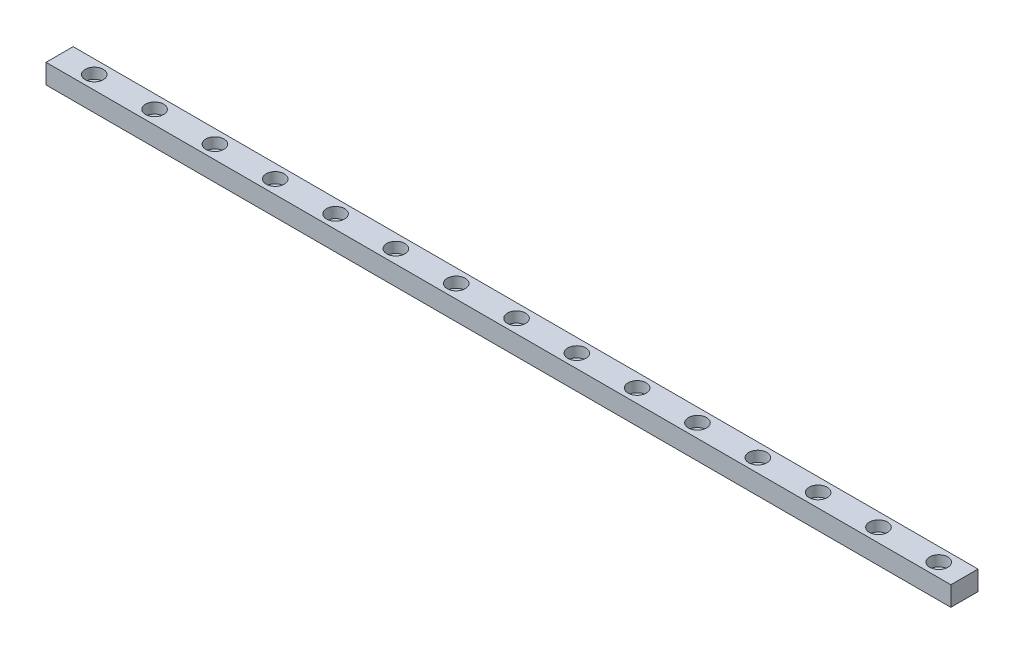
ISO-10303-21;
HEADER;
FILE_DESCRIPTION(('STEP AP214'),'2;1');
FILE_NAME('part.step','',(''),(''),'','','');
FILE_SCHEMA(('AUTOMOTIVE_DESIGN { 1 0 10303 214 1 1 1 1 }'));
ENDSEC;
DATA;
#1=APPLICATION_CONTEXT('core data for automotive mechanical design processes');
#2=APPLICATION_PROTOCOL_DEFINITION('international standard','automotive_design',2000,#1);
#3=PRODUCT_CONTEXT('',#1,'mechanical');
#4=PRODUCT('Part','Part','',(#3));
#5=PRODUCT_RELATED_PRODUCT_CATEGORY('part','',(#4));
#6=PRODUCT_DEFINITION_FORMATION('','',#4);
#7=PRODUCT_DEFINITION_CONTEXT('part definition',#1,'design');
#8=PRODUCT_DEFINITION('design','',#6,#7);
#9=PRODUCT_DEFINITION_SHAPE('','',#8);
#10=(LENGTH_UNIT() NAMED_UNIT(*) SI_UNIT(.MILLI.,.METRE.));
#11=(NAMED_UNIT(*) PLANE_ANGLE_UNIT() SI_UNIT($,.RADIAN.));
#12=(NAMED_UNIT(*) SI_UNIT($,.STERADIAN.) SOLID_ANGLE_UNIT());
#13=UNCERTAINTY_MEASURE_WITH_UNIT(LENGTH_MEASURE(1.E-05),#10,'distance_accuracy_value','');
#14=(GEOMETRIC_REPRESENTATION_CONTEXT(3) GLOBAL_UNCERTAINTY_ASSIGNED_CONTEXT((#13)) GLOBAL_UNIT_ASSIGNED_CONTEXT((#10,
#11,#12)) REPRESENTATION_CONTEXT('',''));
#15=CARTESIAN_POINT('',(0.,0.,0.));
#16=DIRECTION('',(0.,0.,1.));
#17=DIRECTION('',(1.,0.,0.));
#18=AXIS2_PLACEMENT_3D('',#15,#16,#17);
#19=CARTESIAN_POINT('',(141.5,-6.5,0.));
#20=DIRECTION('',(0.,1.,0.));
#21=DIRECTION('',(0.,0.,1.));
#22=AXIS2_PLACEMENT_3D('',#19,#20,#21);
#23=CYLINDRICAL_SURFACE('',#22,1.5);
#24=CARTESIAN_POINT('',(141.5,-6.5,0.));
#25=DIRECTION('',(0.,1.,0.));
#26=DIRECTION('',(0.,0.,1.));
#27=AXIS2_PLACEMENT_3D('',#24,#25,#26);
#28=CIRCLE('',#27,1.5);
#29=CARTESIAN_POINT('',(141.5,-6.5,1.5));
#30=VERTEX_POINT('',#29);
#31=EDGE_CURVE('E189',#30,#30,#28,.T.);
#32=ORIENTED_EDGE('',*,*,#31,.F.);
#33=EDGE_LOOP('',(#32));
#34=FACE_BOUND('',#33,.T.);
#35=CARTESIAN_POINT('',(141.5,-3.5,0.));
#36=DIRECTION('',(0.,1.,0.));
#37=DIRECTION('',(0.,0.,1.));
#38=AXIS2_PLACEMENT_3D('',#35,#36,#37);
#39=CIRCLE('',#38,1.5);
#40=CARTESIAN_POINT('',(141.5,-3.5,1.5));
#41=VERTEX_POINT('',#40);
#42=EDGE_CURVE('E47',#41,#41,#39,.F.);
#43=ORIENTED_EDGE('',*,*,#42,.F.);
#44=EDGE_LOOP('',(#43));
#45=FACE_BOUND('',#44,.T.);
#46=ADVANCED_FACE('F43',(#34,#45),#23,.F.);
#47=CARTESIAN_POINT('',(121.5,-6.5,0.));
#48=DIRECTION('',(0.,1.,0.));
#49=DIRECTION('',(0.,0.,1.));
#50=AXIS2_PLACEMENT_3D('',#47,#48,#49);
#51=CYLINDRICAL_SURFACE('',#50,1.5);
#52=CARTESIAN_POINT('',(121.5,-6.5,0.));
#53=DIRECTION('',(0.,1.,0.));
#54=DIRECTION('',(0.,0.,1.));
#55=AXIS2_PLACEMENT_3D('',#52,#53,#54);
#56=CIRCLE('',#55,1.5);
#57=CARTESIAN_POINT('',(121.5,-6.5,1.5));
#58=VERTEX_POINT('',#57);
#59=EDGE_CURVE('E194',#58,#58,#56,.T.);
#60=ORIENTED_EDGE('',*,*,#59,.F.);
#61=EDGE_LOOP('',(#60));
#62=FACE_BOUND('',#61,.T.);
#63=CARTESIAN_POINT('',(121.5,-3.5,0.));
#64=DIRECTION('',(0.,1.,0.));
#65=DIRECTION('',(0.,0.,1.));
#66=AXIS2_PLACEMENT_3D('',#63,#64,#65);
#67=CIRCLE('',#66,1.5);
#68=CARTESIAN_POINT('',(121.5,-3.5,1.5));
#69=VERTEX_POINT('',#68);
#70=EDGE_CURVE('E182',#69,#69,#67,.F.);
#71=ORIENTED_EDGE('',*,*,#70,.F.);
#72=EDGE_LOOP('',(#71));
#73=FACE_BOUND('',#72,.T.);
#74=ADVANCED_FACE('F431',(#62,#73),#51,.F.);
#75=CARTESIAN_POINT('',(101.5,-6.5,0.));
#76=DIRECTION('',(0.,1.,0.));
#77=DIRECTION('',(0.,0.,1.));
#78=AXIS2_PLACEMENT_3D('',#75,#76,#77);
#79=CYLINDRICAL_SURFACE('',#78,1.5);
#80=CARTESIAN_POINT('',(101.5,-6.5,0.));
#81=DIRECTION('',(0.,1.,0.));
#82=DIRECTION('',(0.,0.,1.));
#83=AXIS2_PLACEMENT_3D('',#80,#81,#82);
#84=CIRCLE('',#83,1.5);
#85=CARTESIAN_POINT('',(101.5,-6.5,1.5));
#86=VERTEX_POINT('',#85);
#87=EDGE_CURVE('E200',#86,#86,#84,.T.);
#88=ORIENTED_EDGE('',*,*,#87,.F.);
#89=EDGE_LOOP('',(#88));
#90=FACE_BOUND('',#89,.T.);
#91=CARTESIAN_POINT('',(101.5,-3.5,0.));
#92=DIRECTION('',(0.,1.,0.));
#93=DIRECTION('',(0.,0.,1.));
#94=AXIS2_PLACEMENT_3D('',#91,#92,#93);
#95=CIRCLE('',#94,1.5);
#96=CARTESIAN_POINT('',(101.5,-3.5,1.5));
#97=VERTEX_POINT('',#96);
#98=EDGE_CURVE('E179',#97,#97,#95,.F.);
#99=ORIENTED_EDGE('',*,*,#98,.F.);
#100=EDGE_LOOP('',(#99));
#101=FACE_BOUND('',#100,.T.);
#102=ADVANCED_FACE('F437',(#90,#101),#79,.F.);
#103=CARTESIAN_POINT('',(81.5,-6.5,0.));
#104=DIRECTION('',(0.,1.,0.));
#105=DIRECTION('',(0.,0.,1.));
#106=AXIS2_PLACEMENT_3D('',#103,#104,#105);
#107=CYLINDRICAL_SURFACE('',#106,1.5);
#108=CARTESIAN_POINT('',(81.5,-6.5,0.));
#109=DIRECTION('',(0.,1.,0.));
#110=DIRECTION('',(0.,0.,1.));
#111=AXIS2_PLACEMENT_3D('',#108,#109,#110);
#112=CIRCLE('',#111,1.5);
#113=CARTESIAN_POINT('',(81.5,-6.5,1.5));
#114=VERTEX_POINT('',#113);
#115=EDGE_CURVE('E247',#114,#114,#112,.T.);
#116=ORIENTED_EDGE('',*,*,#115,.F.);
#117=EDGE_LOOP('',(#116));
#118=FACE_BOUND('',#117,.T.);
#119=CARTESIAN_POINT('',(81.5,-3.5,0.));
#120=DIRECTION('',(0.,1.,0.));
#121=DIRECTION('',(0.,0.,1.));
#122=AXIS2_PLACEMENT_3D('',#119,#120,#121);
#123=CIRCLE('',#122,1.5);
#124=CARTESIAN_POINT('',(81.5,-3.5,1.5));
#125=VERTEX_POINT('',#124);
#126=EDGE_CURVE('E175',#125,#125,#123,.F.);
#127=ORIENTED_EDGE('',*,*,#126,.F.);
#128=EDGE_LOOP('',(#127));
#129=FACE_BOUND('',#128,.T.);
#130=ADVANCED_FACE('F444',(#118,#129),#107,.F.);
#131=CARTESIAN_POINT('',(61.5,-6.5,0.));
#132=DIRECTION('',(0.,1.,0.));
#133=DIRECTION('',(0.,0.,1.));
#134=AXIS2_PLACEMENT_3D('',#131,#132,#133);
#135=CYLINDRICAL_SURFACE('',#134,1.5);
#136=CARTESIAN_POINT('',(61.5,-6.5,0.));
#137=DIRECTION('',(0.,1.,0.));
#138=DIRECTION('',(0.,0.,1.));
#139=AXIS2_PLACEMENT_3D('',#136,#137,#138);
#140=CIRCLE('',#139,1.5);
#141=CARTESIAN_POINT('',(61.5,-6.5,1.5));
#142=VERTEX_POINT('',#141);
#143=EDGE_CURVE('E243',#142,#142,#140,.T.);
#144=ORIENTED_EDGE('',*,*,#143,.F.);
#145=EDGE_LOOP('',(#144));
#146=FACE_BOUND('',#145,.T.);
#147=CARTESIAN_POINT('',(61.5,-3.5,0.));
#148=DIRECTION('',(0.,1.,0.));
#149=DIRECTION('',(0.,0.,1.));
#150=AXIS2_PLACEMENT_3D('',#147,#148,#149);
#151=CIRCLE('',#150,1.5);
#152=CARTESIAN_POINT('',(61.5,-3.5,1.5));
#153=VERTEX_POINT('',#152);
#154=EDGE_CURVE('E171',#153,#153,#151,.F.);
#155=ORIENTED_EDGE('',*,*,#154,.F.);
#156=EDGE_LOOP('',(#155));
#157=FACE_BOUND('',#156,.T.);
#158=ADVANCED_FACE('F448',(#146,#157),#135,.F.);
#159=CARTESIAN_POINT('',(41.5,-6.5,0.));
#160=DIRECTION('',(0.,1.,0.));
#161=DIRECTION('',(0.,0.,1.));
#162=AXIS2_PLACEMENT_3D('',#159,#160,#161);
#163=CYLINDRICAL_SURFACE('',#162,1.5);
#164=CARTESIAN_POINT('',(41.5,-6.5,0.));
#165=DIRECTION('',(0.,1.,0.));
#166=DIRECTION('',(0.,0.,1.));
#167=AXIS2_PLACEMENT_3D('',#164,#165,#166);
#168=CIRCLE('',#167,1.5);
#169=CARTESIAN_POINT('',(41.5,-6.5,1.5));
#170=VERTEX_POINT('',#169);
#171=EDGE_CURVE('E239',#170,#170,#168,.T.);
#172=ORIENTED_EDGE('',*,*,#171,.F.);
#173=EDGE_LOOP('',(#172));
#174=FACE_BOUND('',#173,.T.);
#175=CARTESIAN_POINT('',(41.5,-3.5,0.));
#176=DIRECTION('',(0.,1.,0.));
#177=DIRECTION('',(0.,0.,1.));
#178=AXIS2_PLACEMENT_3D('',#175,#176,#177);
#179=CIRCLE('',#178,1.5);
#180=CARTESIAN_POINT('',(41.5,-3.5,1.5));
#181=VERTEX_POINT('',#180);
#182=EDGE_CURVE('E167',#181,#181,#179,.F.);
#183=ORIENTED_EDGE('',*,*,#182,.F.);
#184=EDGE_LOOP('',(#183));
#185=FACE_BOUND('',#184,.T.);
#186=ADVANCED_FACE('F452',(#174,#185),#163,.F.);
#187=CARTESIAN_POINT('',(21.5,-6.5,0.));
#188=DIRECTION('',(0.,1.,0.));
#189=DIRECTION('',(0.,0.,1.));
#190=AXIS2_PLACEMENT_3D('',#187,#188,#189);
#191=CYLINDRICAL_SURFACE('',#190,1.5);
#192=CARTESIAN_POINT('',(21.5,-6.5,0.));
#193=DIRECTION('',(0.,1.,0.));
#194=DIRECTION('',(0.,0.,1.));
#195=AXIS2_PLACEMENT_3D('',#192,#193,#194);
#196=CIRCLE('',#195,1.5);
#197=CARTESIAN_POINT('',(21.5,-6.5,1.5));
#198=VERTEX_POINT('',#197);
#199=EDGE_CURVE('E235',#198,#198,#196,.T.);
#200=ORIENTED_EDGE('',*,*,#199,.F.);
#201=EDGE_LOOP('',(#200));
#202=FACE_BOUND('',#201,.T.);
#203=CARTESIAN_POINT('',(21.5,-3.5,0.));
#204=DIRECTION('',(0.,1.,0.));
#205=DIRECTION('',(0.,0.,1.));
#206=AXIS2_PLACEMENT_3D('',#203,#204,#205);
#207=CIRCLE('',#206,1.5);
#208=CARTESIAN_POINT('',(21.5,-3.5,1.5));
#209=VERTEX_POINT('',#208);
#210=EDGE_CURVE('E163',#209,#209,#207,.F.);
#211=ORIENTED_EDGE('',*,*,#210,.F.);
#212=EDGE_LOOP('',(#211));
#213=FACE_BOUND('',#212,.T.);
#214=ADVANCED_FACE('F456',(#202,#213),#191,.F.);
#215=CARTESIAN_POINT('',(1.50000000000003,-6.5,0.));
#216=DIRECTION('',(0.,1.,0.));
#217=DIRECTION('',(0.,0.,1.));
#218=AXIS2_PLACEMENT_3D('',#215,#216,#217);
#219=CYLINDRICAL_SURFACE('',#218,1.5);
#220=CARTESIAN_POINT('',(1.50000000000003,-6.5,0.));
#221=DIRECTION('',(0.,1.,0.));
#222=DIRECTION('',(0.,0.,1.));
#223=AXIS2_PLACEMENT_3D('',#220,#221,#222);
#224=CIRCLE('',#223,1.5);
#225=CARTESIAN_POINT('',(1.50000000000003,-6.5,1.5));
#226=VERTEX_POINT('',#225);
#227=EDGE_CURVE('E231',#226,#226,#224,.T.);
#228=ORIENTED_EDGE('',*,*,#227,.F.);
#229=EDGE_LOOP('',(#228));
#230=FACE_BOUND('',#229,.T.);
#231=CARTESIAN_POINT('',(1.50000000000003,-3.5,0.));
#232=DIRECTION('',(0.,1.,0.));
#233=DIRECTION('',(0.,0.,1.));
#234=AXIS2_PLACEMENT_3D('',#231,#232,#233);
#235=CIRCLE('',#234,1.5);
#236=CARTESIAN_POINT('',(1.50000000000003,-3.5,1.5));
#237=VERTEX_POINT('',#236);
#238=EDGE_CURVE('E159',#237,#237,#235,.F.);
#239=ORIENTED_EDGE('',*,*,#238,.F.);
#240=EDGE_LOOP('',(#239));
#241=FACE_BOUND('',#240,.T.);
#242=ADVANCED_FACE('F460',(#230,#241),#219,.F.);
#243=CARTESIAN_POINT('',(-18.5,-6.5,0.));
#244=DIRECTION('',(0.,1.,0.));
#245=DIRECTION('',(0.,0.,1.));
#246=AXIS2_PLACEMENT_3D('',#243,#244,#245);
#247=CYLINDRICAL_SURFACE('',#246,1.5);
#248=CARTESIAN_POINT('',(-18.5,-6.5,0.));
#249=DIRECTION('',(0.,1.,0.));
#250=DIRECTION('',(0.,0.,1.));
#251=AXIS2_PLACEMENT_3D('',#248,#249,#250);
#252=CIRCLE('',#251,1.5);
#253=CARTESIAN_POINT('',(-18.5,-6.5,1.5));
#254=VERTEX_POINT('',#253);
#255=EDGE_CURVE('E227',#254,#254,#252,.T.);
#256=ORIENTED_EDGE('',*,*,#255,.F.);
#257=EDGE_LOOP('',(#256));
#258=FACE_BOUND('',#257,.T.);
#259=CARTESIAN_POINT('',(-18.5,-3.5,0.));
#260=DIRECTION('',(0.,1.,0.));
#261=DIRECTION('',(0.,0.,1.));
#262=AXIS2_PLACEMENT_3D('',#259,#260,#261);
#263=CIRCLE('',#262,1.5);
#264=CARTESIAN_POINT('',(-18.5,-3.5,1.5));
#265=VERTEX_POINT('',#264);
#266=EDGE_CURVE('E155',#265,#265,#263,.F.);
#267=ORIENTED_EDGE('',*,*,#266,.F.);
#268=EDGE_LOOP('',(#267));
#269=FACE_BOUND('',#268,.T.);
#270=ADVANCED_FACE('F464',(#258,#269),#247,.F.);
#271=CARTESIAN_POINT('',(-38.5,-6.5,0.));
#272=DIRECTION('',(0.,1.,0.));
#273=DIRECTION('',(0.,0.,1.));
#274=AXIS2_PLACEMENT_3D('',#271,#272,#273);
#275=CYLINDRICAL_SURFACE('',#274,1.5);
#276=CARTESIAN_POINT('',(-38.5,-6.5,0.));
#277=DIRECTION('',(0.,1.,0.));
#278=DIRECTION('',(0.,0.,1.));
#279=AXIS2_PLACEMENT_3D('',#276,#277,#278);
#280=CIRCLE('',#279,1.5);
#281=CARTESIAN_POINT('',(-38.5,-6.5,1.5));
#282=VERTEX_POINT('',#281);
#283=EDGE_CURVE('E223',#282,#282,#280,.T.);
#284=ORIENTED_EDGE('',*,*,#283,.F.);
#285=EDGE_LOOP('',(#284));
#286=FACE_BOUND('',#285,.T.);
#287=CARTESIAN_POINT('',(-38.5,-3.5,0.));
#288=DIRECTION('',(0.,1.,0.));
#289=DIRECTION('',(0.,0.,1.));
#290=AXIS2_PLACEMENT_3D('',#287,#288,#289);
#291=CIRCLE('',#290,1.5);
#292=CARTESIAN_POINT('',(-38.5,-3.5,1.5));
#293=VERTEX_POINT('',#292);
#294=EDGE_CURVE('E151',#293,#293,#291,.F.);
#295=ORIENTED_EDGE('',*,*,#294,.F.);
#296=EDGE_LOOP('',(#295));
#297=FACE_BOUND('',#296,.T.);
#298=ADVANCED_FACE('F468',(#286,#297),#275,.F.);
#299=CARTESIAN_POINT('',(-58.5,-6.5,0.));
#300=DIRECTION('',(0.,1.,0.));
#301=DIRECTION('',(0.,0.,1.));
#302=AXIS2_PLACEMENT_3D('',#299,#300,#301);
#303=CYLINDRICAL_SURFACE('',#302,1.5);
#304=CARTESIAN_POINT('',(-58.5,-6.5,0.));
#305=DIRECTION('',(0.,1.,0.));
#306=DIRECTION('',(0.,0.,1.));
#307=AXIS2_PLACEMENT_3D('',#304,#305,#306);
#308=CIRCLE('',#307,1.5);
#309=CARTESIAN_POINT('',(-58.5,-6.5,1.5));
#310=VERTEX_POINT('',#309);
#311=EDGE_CURVE('E219',#310,#310,#308,.T.);
#312=ORIENTED_EDGE('',*,*,#311,.F.);
#313=EDGE_LOOP('',(#312));
#314=FACE_BOUND('',#313,.T.);
#315=CARTESIAN_POINT('',(-58.5,-3.5,0.));
#316=DIRECTION('',(0.,1.,0.));
#317=DIRECTION('',(0.,0.,1.));
#318=AXIS2_PLACEMENT_3D('',#315,#316,#317);
#319=CIRCLE('',#318,1.5);
#320=CARTESIAN_POINT('',(-58.5,-3.5,1.5));
#321=VERTEX_POINT('',#320);
#322=EDGE_CURVE('E147',#321,#321,#319,.F.);
#323=ORIENTED_EDGE('',*,*,#322,.F.);
#324=EDGE_LOOP('',(#323));
#325=FACE_BOUND('',#324,.T.);
#326=ADVANCED_FACE('F472',(#314,#325),#303,.F.);
#327=CARTESIAN_POINT('',(-78.5,-6.5,0.));
#328=DIRECTION('',(0.,1.,0.));
#329=DIRECTION('',(0.,0.,1.));
#330=AXIS2_PLACEMENT_3D('',#327,#328,#329);
#331=CYLINDRICAL_SURFACE('',#330,1.5);
#332=CARTESIAN_POINT('',(-78.5,-6.5,0.));
#333=DIRECTION('',(0.,1.,0.));
#334=DIRECTION('',(0.,0.,1.));
#335=AXIS2_PLACEMENT_3D('',#332,#333,#334);
#336=CIRCLE('',#335,1.5);
#337=CARTESIAN_POINT('',(-78.5,-6.5,1.5));
#338=VERTEX_POINT('',#337);
#339=EDGE_CURVE('E215',#338,#338,#336,.T.);
#340=ORIENTED_EDGE('',*,*,#339,.F.);
#341=EDGE_LOOP('',(#340));
#342=FACE_BOUND('',#341,.T.);
#343=CARTESIAN_POINT('',(-78.5,-3.5,0.));
#344=DIRECTION('',(0.,1.,0.));
#345=DIRECTION('',(0.,0.,1.));
#346=AXIS2_PLACEMENT_3D('',#343,#344,#345);
#347=CIRCLE('',#346,1.5);
#348=CARTESIAN_POINT('',(-78.5,-3.5,1.5));
#349=VERTEX_POINT('',#348);
#350=EDGE_CURVE('E143',#349,#349,#347,.F.);
#351=ORIENTED_EDGE('',*,*,#350,.F.);
#352=EDGE_LOOP('',(#351));
#353=FACE_BOUND('',#352,.T.);
#354=ADVANCED_FACE('F476',(#342,#353),#331,.F.);
#355=CARTESIAN_POINT('',(-98.5,-6.5,0.));
#356=DIRECTION('',(0.,1.,0.));
#357=DIRECTION('',(0.,0.,1.));
#358=AXIS2_PLACEMENT_3D('',#355,#356,#357);
#359=CYLINDRICAL_SURFACE('',#358,1.5);
#360=CARTESIAN_POINT('',(-98.5,-6.5,0.));
#361=DIRECTION('',(0.,1.,0.));
#362=DIRECTION('',(0.,0.,1.));
#363=AXIS2_PLACEMENT_3D('',#360,#361,#362);
#364=CIRCLE('',#363,1.5);
#365=CARTESIAN_POINT('',(-98.5,-6.5,1.5));
#366=VERTEX_POINT('',#365);
#367=EDGE_CURVE('E211',#366,#366,#364,.T.);
#368=ORIENTED_EDGE('',*,*,#367,.F.);
#369=EDGE_LOOP('',(#368));
#370=FACE_BOUND('',#369,.T.);
#371=CARTESIAN_POINT('',(-98.5,-3.5,0.));
#372=DIRECTION('',(0.,1.,0.));
#373=DIRECTION('',(0.,0.,1.));
#374=AXIS2_PLACEMENT_3D('',#371,#372,#373);
#375=CIRCLE('',#374,1.5);
#376=CARTESIAN_POINT('',(-98.5,-3.5,1.5));
#377=VERTEX_POINT('',#376);
#378=EDGE_CURVE('E139',#377,#377,#375,.F.);
#379=ORIENTED_EDGE('',*,*,#378,.F.);
#380=EDGE_LOOP('',(#379));
#381=FACE_BOUND('',#380,.T.);
#382=ADVANCED_FACE('F480',(#370,#381),#359,.F.);
#383=CARTESIAN_POINT('',(-118.5,-6.5,0.));
#384=DIRECTION('',(0.,1.,0.));
#385=DIRECTION('',(0.,0.,1.));
#386=AXIS2_PLACEMENT_3D('',#383,#384,#385);
#387=CYLINDRICAL_SURFACE('',#386,1.5);
#388=CARTESIAN_POINT('',(-118.5,-6.5,0.));
#389=DIRECTION('',(0.,1.,0.));
#390=DIRECTION('',(0.,0.,1.));
#391=AXIS2_PLACEMENT_3D('',#388,#389,#390);
#392=CIRCLE('',#391,1.5);
#393=CARTESIAN_POINT('',(-118.5,-6.5,1.5));
#394=VERTEX_POINT('',#393);
#395=EDGE_CURVE('E207',#394,#394,#392,.T.);
#396=ORIENTED_EDGE('',*,*,#395,.F.);
#397=EDGE_LOOP('',(#396));
#398=FACE_BOUND('',#397,.T.);
#399=CARTESIAN_POINT('',(-118.5,-3.5,0.));
#400=DIRECTION('',(0.,1.,0.));
#401=DIRECTION('',(0.,0.,1.));
#402=AXIS2_PLACEMENT_3D('',#399,#400,#401);
#403=CIRCLE('',#402,1.5);
#404=CARTESIAN_POINT('',(-118.5,-3.5,1.5));
#405=VERTEX_POINT('',#404);
#406=EDGE_CURVE('E134',#405,#405,#403,.F.);
#407=ORIENTED_EDGE('',*,*,#406,.F.);
#408=EDGE_LOOP('',(#407));
#409=FACE_BOUND('',#408,.T.);
#410=ADVANCED_FACE('F484',(#398,#409),#387,.F.);
#411=CARTESIAN_POINT('',(-138.5,-6.5,0.));
#412=DIRECTION('',(0.,1.,0.));
#413=DIRECTION('',(0.,0.,1.));
#414=AXIS2_PLACEMENT_3D('',#411,#412,#413);
#415=CYLINDRICAL_SURFACE('',#414,1.5);
#416=CARTESIAN_POINT('',(-138.5,-6.5,0.));
#417=DIRECTION('',(0.,1.,0.));
#418=DIRECTION('',(0.,0.,1.));
#419=AXIS2_PLACEMENT_3D('',#416,#417,#418);
#420=CIRCLE('',#419,1.5);
#421=CARTESIAN_POINT('',(-138.5,-6.5,1.5));
#422=VERTEX_POINT('',#421);
#423=EDGE_CURVE('E119',#422,#422,#420,.T.);
#424=ORIENTED_EDGE('',*,*,#423,.F.);
#425=EDGE_LOOP('',(#424));
#426=FACE_BOUND('',#425,.T.);
#427=CARTESIAN_POINT('',(-138.5,-3.5,0.));
#428=DIRECTION('',(0.,1.,0.));
#429=DIRECTION('',(0.,0.,1.));
#430=AXIS2_PLACEMENT_3D('',#427,#428,#429);
#431=CIRCLE('',#430,1.5);
#432=CARTESIAN_POINT('',(-138.5,-3.5,1.5));
#433=VERTEX_POINT('',#432);
#434=EDGE_CURVE('E130',#433,#433,#431,.F.);
#435=ORIENTED_EDGE('',*,*,#434,.F.);
#436=EDGE_LOOP('',(#435));
#437=FACE_BOUND('',#436,.T.);
#438=ADVANCED_FACE('F388',(#426,#437),#415,.F.);
#439=CARTESIAN_POINT('',(150.,0.,-4.5));
#440=DIRECTION('',(0.,-1.,0.));
#441=DIRECTION('',(0.,0.,-1.));
#442=AXIS2_PLACEMENT_3D('',#439,#440,#441);
#443=PLANE('',#442);
#444=CARTESIAN_POINT('',(-138.5,0.,0.));
#445=DIRECTION('',(0.,1.,0.));
#446=DIRECTION('',(0.,0.,1.));
#447=AXIS2_PLACEMENT_3D('',#444,#445,#446);
#448=CIRCLE('',#447,2.99999999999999);
#449=CARTESIAN_POINT('',(-138.5,0.,2.99999999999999));
#450=VERTEX_POINT('',#449);
#451=EDGE_CURVE('E368',#450,#450,#448,.T.);
#452=ORIENTED_EDGE('',*,*,#451,.F.);
#453=EDGE_LOOP('',(#452));
#454=FACE_BOUND('',#453,.T.);
#455=CARTESIAN_POINT('',(-118.5,0.,0.));
#456=DIRECTION('',(0.,1.,0.));
#457=DIRECTION('',(0.,0.,1.));
#458=AXIS2_PLACEMENT_3D('',#455,#456,#457);
#459=CIRCLE('',#458,2.99999999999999);
#460=CARTESIAN_POINT('',(-118.5,0.,2.99999999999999));
#461=VERTEX_POINT('',#460);
#462=EDGE_CURVE('E364',#461,#461,#459,.T.);
#463=ORIENTED_EDGE('',*,*,#462,.F.);
#464=EDGE_LOOP('',(#463));
#465=FACE_BOUND('',#464,.T.);
#466=CARTESIAN_POINT('',(-98.5,0.,0.));
#467=DIRECTION('',(0.,1.,0.));
#468=DIRECTION('',(0.,0.,1.));
#469=AXIS2_PLACEMENT_3D('',#466,#467,#468);
#470=CIRCLE('',#469,2.99999999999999);
#471=CARTESIAN_POINT('',(-98.5,0.,2.99999999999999));
#472=VERTEX_POINT('',#471);
#473=EDGE_CURVE('E356',#472,#472,#470,.T.);
#474=ORIENTED_EDGE('',*,*,#473,.F.);
#475=EDGE_LOOP('',(#474));
#476=FACE_BOUND('',#475,.T.);
#477=CARTESIAN_POINT('',(-78.5,0.,0.));
#478=DIRECTION('',(0.,1.,0.));
#479=DIRECTION('',(0.,0.,1.));
#480=AXIS2_PLACEMENT_3D('',#477,#478,#479);
#481=CIRCLE('',#480,2.99999999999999);
#482=CARTESIAN_POINT('',(-78.5,0.,2.99999999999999));
#483=VERTEX_POINT('',#482);
#484=EDGE_CURVE('E348',#483,#483,#481,.T.);
#485=ORIENTED_EDGE('',*,*,#484,.F.);
#486=EDGE_LOOP('',(#485));
#487=FACE_BOUND('',#486,.T.);
#488=CARTESIAN_POINT('',(-58.5,0.,0.));
#489=DIRECTION('',(0.,1.,0.));
#490=DIRECTION('',(0.,0.,1.));
#491=AXIS2_PLACEMENT_3D('',#488,#489,#490);
#492=CIRCLE('',#491,2.99999999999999);
#493=CARTESIAN_POINT('',(-58.5,0.,2.99999999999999));
#494=VERTEX_POINT('',#493);
#495=EDGE_CURVE('E340',#494,#494,#492,.T.);
#496=ORIENTED_EDGE('',*,*,#495,.F.);
#497=EDGE_LOOP('',(#496));
#498=FACE_BOUND('',#497,.T.);
#499=CARTESIAN_POINT('',(-38.5,0.,0.));
#500=DIRECTION('',(0.,1.,0.));
#501=DIRECTION('',(0.,0.,1.));
#502=AXIS2_PLACEMENT_3D('',#499,#500,#501);
#503=CIRCLE('',#502,2.99999999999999);
#504=CARTESIAN_POINT('',(-38.5,0.,2.99999999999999));
#505=VERTEX_POINT('',#504);
#506=EDGE_CURVE('E332',#505,#505,#503,.T.);
#507=ORIENTED_EDGE('',*,*,#506,.F.);
#508=EDGE_LOOP('',(#507));
#509=FACE_BOUND('',#508,.T.);
#510=CARTESIAN_POINT('',(-18.5,0.,0.));
#511=DIRECTION('',(0.,1.,0.));
#512=DIRECTION('',(0.,0.,1.));
#513=AXIS2_PLACEMENT_3D('',#510,#511,#512);
#514=CIRCLE('',#513,2.99999999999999);
#515=CARTESIAN_POINT('',(-18.5,0.,2.99999999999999));
#516=VERTEX_POINT('',#515);
#517=EDGE_CURVE('E324',#516,#516,#514,.T.);
#518=ORIENTED_EDGE('',*,*,#517,.F.);
#519=EDGE_LOOP('',(#518));
#520=FACE_BOUND('',#519,.T.);
#521=CARTESIAN_POINT('',(1.50000000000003,0.,0.));
#522=DIRECTION('',(0.,1.,0.));
#523=DIRECTION('',(0.,0.,1.));
#524=AXIS2_PLACEMENT_3D('',#521,#522,#523);
#525=CIRCLE('',#524,2.99999999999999);
#526=CARTESIAN_POINT('',(1.50000000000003,0.,2.99999999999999));
#527=VERTEX_POINT('',#526);
#528=EDGE_CURVE('E316',#527,#527,#525,.T.);
#529=ORIENTED_EDGE('',*,*,#528,.F.);
#530=EDGE_LOOP('',(#529));
#531=FACE_BOUND('',#530,.T.);
#532=CARTESIAN_POINT('',(21.5,0.,0.));
#533=DIRECTION('',(0.,1.,0.));
#534=DIRECTION('',(0.,0.,1.));
#535=AXIS2_PLACEMENT_3D('',#532,#533,#534);
#536=CIRCLE('',#535,2.99999999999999);
#537=CARTESIAN_POINT('',(21.5,0.,2.99999999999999));
#538=VERTEX_POINT('',#537);
#539=EDGE_CURVE('E308',#538,#538,#536,.T.);
#540=ORIENTED_EDGE('',*,*,#539,.F.);
#541=EDGE_LOOP('',(#540));
#542=FACE_BOUND('',#541,.T.);
#543=CARTESIAN_POINT('',(41.5,0.,0.));
#544=DIRECTION('',(0.,1.,0.));
#545=DIRECTION('',(0.,0.,1.));
#546=AXIS2_PLACEMENT_3D('',#543,#544,#545);
#547=CIRCLE('',#546,2.99999999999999);
#548=CARTESIAN_POINT('',(41.5,0.,2.99999999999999));
#549=VERTEX_POINT('',#548);
#550=EDGE_CURVE('E300',#549,#549,#547,.T.);
#551=ORIENTED_EDGE('',*,*,#550,.F.);
#552=EDGE_LOOP('',(#551));
#553=FACE_BOUND('',#552,.T.);
#554=CARTESIAN_POINT('',(61.5,0.,0.));
#555=DIRECTION('',(0.,1.,0.));
#556=DIRECTION('',(0.,0.,1.));
#557=AXIS2_PLACEMENT_3D('',#554,#555,#556);
#558=CIRCLE('',#557,2.99999999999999);
#559=CARTESIAN_POINT('',(61.5,0.,2.99999999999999));
#560=VERTEX_POINT('',#559);
#561=EDGE_CURVE('E292',#560,#560,#558,.T.);
#562=ORIENTED_EDGE('',*,*,#561,.F.);
#563=EDGE_LOOP('',(#562));
#564=FACE_BOUND('',#563,.T.);
#565=CARTESIAN_POINT('',(81.5,0.,0.));
#566=DIRECTION('',(0.,1.,0.));
#567=DIRECTION('',(0.,0.,1.));
#568=AXIS2_PLACEMENT_3D('',#565,#566,#567);
#569=CIRCLE('',#568,2.99999999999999);
#570=CARTESIAN_POINT('',(81.5,0.,2.99999999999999));
#571=VERTEX_POINT('',#570);
#572=EDGE_CURVE('E284',#571,#571,#569,.T.);
#573=ORIENTED_EDGE('',*,*,#572,.F.);
#574=EDGE_LOOP('',(#573));
#575=FACE_BOUND('',#574,.T.);
#576=CARTESIAN_POINT('',(101.5,0.,0.));
#577=DIRECTION('',(0.,1.,0.));
#578=DIRECTION('',(0.,0.,1.));
#579=AXIS2_PLACEMENT_3D('',#576,#577,#578);
#580=CIRCLE('',#579,2.99999999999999);
#581=CARTESIAN_POINT('',(101.5,0.,2.99999999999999));
#582=VERTEX_POINT('',#581);
#583=EDGE_CURVE('E276',#582,#582,#580,.T.);
#584=ORIENTED_EDGE('',*,*,#583,.F.);
#585=EDGE_LOOP('',(#584));
#586=FACE_BOUND('',#585,.T.);
#587=CARTESIAN_POINT('',(121.5,0.,0.));
#588=DIRECTION('',(0.,1.,0.));
#589=DIRECTION('',(0.,0.,1.));
#590=AXIS2_PLACEMENT_3D('',#587,#588,#589);
#591=CIRCLE('',#590,2.99999999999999);
#592=CARTESIAN_POINT('',(121.5,0.,2.99999999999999));
#593=VERTEX_POINT('',#592);
#594=EDGE_CURVE('E268',#593,#593,#591,.T.);
#595=ORIENTED_EDGE('',*,*,#594,.F.);
#596=EDGE_LOOP('',(#595));
#597=FACE_BOUND('',#596,.T.);
#598=CARTESIAN_POINT('',(141.5,0.,0.));
#599=DIRECTION('',(0.,1.,0.));
#600=DIRECTION('',(0.,0.,1.));
#601=AXIS2_PLACEMENT_3D('',#598,#599,#600);
#602=CIRCLE('',#601,2.99999999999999);
#603=CARTESIAN_POINT('',(141.5,0.,2.99999999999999));
#604=VERTEX_POINT('',#603);
#605=EDGE_CURVE('E260',#604,#604,#602,.T.);
#606=ORIENTED_EDGE('',*,*,#605,.F.);
#607=EDGE_LOOP('',(#606));
#608=FACE_BOUND('',#607,.T.);
#609=DIRECTION('',(0.,0.,1.));
#610=VECTOR('',#609,1.);
#611=CARTESIAN_POINT('',(-150.,0.,-4.5));
#612=LINE('',#611,#610);
#613=CARTESIAN_POINT('',(-150.,0.,-4.5));
#614=VERTEX_POINT('',#613);
#615=CARTESIAN_POINT('',(-150.,0.,4.5));
#616=VERTEX_POINT('',#615);
#617=EDGE_CURVE('E115',#614,#616,#612,.T.);
#618=ORIENTED_EDGE('',*,*,#617,.T.);
#619=DIRECTION('',(-1.,0.,0.));
#620=VECTOR('',#619,1.);
#621=CARTESIAN_POINT('',(150.,0.,4.5));
#622=LINE('',#621,#620);
#623=CARTESIAN_POINT('',(150.,0.,4.5));
#624=VERTEX_POINT('',#623);
#625=EDGE_CURVE('E11',#624,#616,#622,.T.);
#626=ORIENTED_EDGE('',*,*,#625,.F.);
#627=DIRECTION('',(0.,0.,1.));
#628=VECTOR('',#627,1.);
#629=CARTESIAN_POINT('',(150.,0.,-4.5));
#630=LINE('',#629,#628);
#631=CARTESIAN_POINT('',(150.,0.,-4.5));
#632=VERTEX_POINT('',#631);
#633=EDGE_CURVE('E98',#632,#624,#630,.T.);
#634=ORIENTED_EDGE('',*,*,#633,.F.);
#635=DIRECTION('',(-1.,0.,0.));
#636=VECTOR('',#635,1.);
#637=CARTESIAN_POINT('',(150.,0.,-4.5));
#638=LINE('',#637,#636);
#639=EDGE_CURVE('E111',#632,#614,#638,.T.);
#640=ORIENTED_EDGE('',*,*,#639,.T.);
#641=EDGE_LOOP('',(#618,#626,#634,#640));
#642=FACE_BOUND('',#641,.T.);
#643=ADVANCED_FACE('F45',(#454,#465,#476,#487,#498,#509,#520,#531,#542,#553,#564,#575,#586,#597,
#608,#642),#443,.F.);
#644=CARTESIAN_POINT('',(150.,0.,4.5));
#645=DIRECTION('',(0.,0.,-1.));
#646=DIRECTION('',(0.,1.,0.));
#647=AXIS2_PLACEMENT_3D('',#644,#645,#646);
#648=PLANE('',#647);
#649=DIRECTION('',(0.,-1.,0.));
#650=VECTOR('',#649,1.);
#651=CARTESIAN_POINT('',(-150.,0.,4.5));
#652=LINE('',#651,#650);
#653=CARTESIAN_POINT('',(-150.,-6.5,4.5));
#654=VERTEX_POINT('',#653);
#655=EDGE_CURVE('E103',#616,#654,#652,.T.);
#656=ORIENTED_EDGE('',*,*,#655,.T.);
#657=DIRECTION('',(-1.,0.,0.));
#658=VECTOR('',#657,1.);
#659=CARTESIAN_POINT('',(150.,-6.5,4.5));
#660=LINE('',#659,#658);
#661=CARTESIAN_POINT('',(150.,-6.5,4.5));
#662=VERTEX_POINT('',#661);
#663=EDGE_CURVE('E54',#662,#654,#660,.T.);
#664=ORIENTED_EDGE('',*,*,#663,.F.);
#665=DIRECTION('',(0.,-1.,0.));
#666=VECTOR('',#665,1.);
#667=CARTESIAN_POINT('',(150.,0.,4.5));
#668=LINE('',#667,#666);
#669=EDGE_CURVE('E93',#624,#662,#668,.T.);
#670=ORIENTED_EDGE('',*,*,#669,.F.);
#671=ORIENTED_EDGE('',*,*,#625,.T.);
#672=EDGE_LOOP('',(#656,#664,#670,#671));
#673=FACE_BOUND('',#672,.T.);
#674=ADVANCED_FACE('F102',(#673),#648,.F.);
#675=CARTESIAN_POINT('',(150.,-6.5,4.5));
#676=DIRECTION('',(0.,1.,0.));
#677=DIRECTION('',(0.,0.,1.));
#678=AXIS2_PLACEMENT_3D('',#675,#676,#677);
#679=PLANE('',#678);
#680=ORIENTED_EDGE('',*,*,#423,.T.);
#681=EDGE_LOOP('',(#680));
#682=FACE_BOUND('',#681,.T.);
#683=ORIENTED_EDGE('',*,*,#395,.T.);
#684=EDGE_LOOP('',(#683));
#685=FACE_BOUND('',#684,.T.);
#686=ORIENTED_EDGE('',*,*,#367,.T.);
#687=EDGE_LOOP('',(#686));
#688=FACE_BOUND('',#687,.T.);
#689=ORIENTED_EDGE('',*,*,#339,.T.);
#690=EDGE_LOOP('',(#689));
#691=FACE_BOUND('',#690,.T.);
#692=ORIENTED_EDGE('',*,*,#311,.T.);
#693=EDGE_LOOP('',(#692));
#694=FACE_BOUND('',#693,.T.);
#695=ORIENTED_EDGE('',*,*,#283,.T.);
#696=EDGE_LOOP('',(#695));
#697=FACE_BOUND('',#696,.T.);
#698=ORIENTED_EDGE('',*,*,#255,.T.);
#699=EDGE_LOOP('',(#698));
#700=FACE_BOUND('',#699,.T.);
#701=ORIENTED_EDGE('',*,*,#227,.T.);
#702=EDGE_LOOP('',(#701));
#703=FACE_BOUND('',#702,.T.);
#704=ORIENTED_EDGE('',*,*,#199,.T.);
#705=EDGE_LOOP('',(#704));
#706=FACE_BOUND('',#705,.T.);
#707=ORIENTED_EDGE('',*,*,#171,.T.);
#708=EDGE_LOOP('',(#707));
#709=FACE_BOUND('',#708,.T.);
#710=ORIENTED_EDGE('',*,*,#143,.T.);
#711=EDGE_LOOP('',(#710));
#712=FACE_BOUND('',#711,.T.);
#713=ORIENTED_EDGE('',*,*,#115,.T.);
#714=EDGE_LOOP('',(#713));
#715=FACE_BOUND('',#714,.T.);
#716=ORIENTED_EDGE('',*,*,#87,.T.);
#717=EDGE_LOOP('',(#716));
#718=FACE_BOUND('',#717,.T.);
#719=ORIENTED_EDGE('',*,*,#59,.T.);
#720=EDGE_LOOP('',(#719));
#721=FACE_BOUND('',#720,.T.);
#722=ORIENTED_EDGE('',*,*,#31,.T.);
#723=EDGE_LOOP('',(#722));
#724=FACE_BOUND('',#723,.T.);
#725=DIRECTION('',(0.,0.,-1.));
#726=VECTOR('',#725,1.);
#727=CARTESIAN_POINT('',(-150.,-6.5,4.5));
#728=LINE('',#727,#726);
#729=CARTESIAN_POINT('',(-150.,-6.5,-4.5));
#730=VERTEX_POINT('',#729);
#731=EDGE_CURVE('E80',#654,#730,#728,.T.);
#732=ORIENTED_EDGE('',*,*,#731,.T.);
#733=DIRECTION('',(-1.,0.,0.));
#734=VECTOR('',#733,1.);
#735=CARTESIAN_POINT('',(150.,-6.5,-4.5));
#736=LINE('',#735,#734);
#737=CARTESIAN_POINT('',(150.,-6.5,-4.5));
#738=VERTEX_POINT('',#737);
#739=EDGE_CURVE('E105',#738,#730,#736,.T.);
#740=ORIENTED_EDGE('',*,*,#739,.F.);
#741=DIRECTION('',(0.,0.,-1.));
#742=VECTOR('',#741,1.);
#743=CARTESIAN_POINT('',(150.,-6.5,4.5));
#744=LINE('',#743,#742);
#745=EDGE_CURVE('E96',#662,#738,#744,.T.);
#746=ORIENTED_EDGE('',*,*,#745,.F.);
#747=ORIENTED_EDGE('',*,*,#663,.T.);
#748=EDGE_LOOP('',(#732,#740,#746,#747));
#749=FACE_BOUND('',#748,.T.);
#750=ADVANCED_FACE('F107',(#682,#685,#688,#691,#694,#697,#700,#703,#706,#709,#712,#715,#718,
#721,#724,#749),#679,.F.);
#751=CARTESIAN_POINT('',(150.,-6.5,-4.5));
#752=DIRECTION('',(0.,0.,1.));
#753=DIRECTION('',(1.,0.,0.));
#754=AXIS2_PLACEMENT_3D('',#751,#752,#753);
#755=PLANE('',#754);
#756=DIRECTION('',(0.,1.,0.));
#757=VECTOR('',#756,1.);
#758=CARTESIAN_POINT('',(-150.,-6.5,-4.5));
#759=LINE('',#758,#757);
#760=EDGE_CURVE('E86',#730,#614,#759,.T.);
#761=ORIENTED_EDGE('',*,*,#760,.T.);
#762=ORIENTED_EDGE('',*,*,#639,.F.);
#763=DIRECTION('',(0.,1.,0.));
#764=VECTOR('',#763,1.);
#765=CARTESIAN_POINT('',(150.,-6.5,-4.5));
#766=LINE('',#765,#764);
#767=EDGE_CURVE('E63',#738,#632,#766,.T.);
#768=ORIENTED_EDGE('',*,*,#767,.F.);
#769=ORIENTED_EDGE('',*,*,#739,.T.);
#770=EDGE_LOOP('',(#761,#762,#768,#769));
#771=FACE_BOUND('',#770,.T.);
#772=ADVANCED_FACE('F427',(#771),#755,.F.);
#773=CARTESIAN_POINT('',(150.,0.,0.));
#774=DIRECTION('',(1.,0.,0.));
#775=DIRECTION('',(0.,0.,-1.));
#776=AXIS2_PLACEMENT_3D('',#773,#774,#775);
#777=PLANE('',#776);
#778=ORIENTED_EDGE('',*,*,#633,.T.);
#779=ORIENTED_EDGE('',*,*,#669,.T.);
#780=ORIENTED_EDGE('',*,*,#745,.T.);
#781=ORIENTED_EDGE('',*,*,#767,.T.);
#782=EDGE_LOOP('',(#778,#779,#780,#781));
#783=FACE_BOUND('',#782,.T.);
#784=ADVANCED_FACE('F94',(#783),#777,.T.);
#785=CARTESIAN_POINT('',(-150.,0.,0.));
#786=DIRECTION('',(1.,0.,0.));
#787=DIRECTION('',(0.,0.,-1.));
#788=AXIS2_PLACEMENT_3D('',#785,#786,#787);
#789=PLANE('',#788);
#790=ORIENTED_EDGE('',*,*,#617,.F.);
#791=ORIENTED_EDGE('',*,*,#760,.F.);
#792=ORIENTED_EDGE('',*,*,#731,.F.);
#793=ORIENTED_EDGE('',*,*,#655,.F.);
#794=EDGE_LOOP('',(#790,#791,#792,#793));
#795=FACE_BOUND('',#794,.T.);
#796=ADVANCED_FACE('F419',(#795),#789,.F.);
#797=CARTESIAN_POINT('',(-138.5,-3.5,0.));
#798=DIRECTION('',(0.,1.,0.));
#799=DIRECTION('',(0.,0.,1.));
#800=AXIS2_PLACEMENT_3D('',#797,#798,#799);
#801=PLANE('',#800);
#802=CARTESIAN_POINT('',(-138.5,-3.5,0.));
#803=DIRECTION('',(0.,1.,0.));
#804=DIRECTION('',(0.,0.,1.));
#805=AXIS2_PLACEMENT_3D('',#802,#803,#804);
#806=CIRCLE('',#805,2.99999999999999);
#807=CARTESIAN_POINT('',(-138.5,-3.5,2.99999999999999));
#808=VERTEX_POINT('',#807);
#809=EDGE_CURVE('E135',#808,#808,#806,.T.);
#810=ORIENTED_EDGE('',*,*,#809,.T.);
#811=EDGE_LOOP('',(#810));
#812=FACE_BOUND('',#811,.T.);
#813=ORIENTED_EDGE('',*,*,#434,.T.);
#814=EDGE_LOOP('',(#813));
#815=FACE_BOUND('',#814,.T.);
#816=ADVANCED_FACE('F376',(#812,#815),#801,.T.);
#817=CARTESIAN_POINT('',(-138.5,-3.5,0.));
#818=DIRECTION('',(0.,1.,0.));
#819=DIRECTION('',(0.,0.,1.));
#820=AXIS2_PLACEMENT_3D('',#817,#818,#819);
#821=CYLINDRICAL_SURFACE('',#820,2.99999999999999);
#822=ORIENTED_EDGE('',*,*,#809,.F.);
#823=EDGE_LOOP('',(#822));
#824=FACE_BOUND('',#823,.T.);
#825=ORIENTED_EDGE('',*,*,#451,.T.);
#826=EDGE_LOOP('',(#825));
#827=FACE_BOUND('',#826,.T.);
#828=ADVANCED_FACE('F379',(#824,#827),#821,.F.);
#829=CARTESIAN_POINT('',(-118.5,-3.5,0.));
#830=DIRECTION('',(0.,1.,0.));
#831=DIRECTION('',(0.,0.,1.));
#832=AXIS2_PLACEMENT_3D('',#829,#830,#831);
#833=PLANE('',#832);
#834=CARTESIAN_POINT('',(-118.5,-3.5,0.));
#835=DIRECTION('',(0.,1.,0.));
#836=DIRECTION('',(0.,0.,1.));
#837=AXIS2_PLACEMENT_3D('',#834,#835,#836);
#838=CIRCLE('',#837,2.99999999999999);
#839=CARTESIAN_POINT('',(-118.5,-3.5,2.99999999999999));
#840=VERTEX_POINT('',#839);
#841=EDGE_CURVE('E360',#840,#840,#838,.T.);
#842=ORIENTED_EDGE('',*,*,#841,.T.);
#843=EDGE_LOOP('',(#842));
#844=FACE_BOUND('',#843,.T.);
#845=ORIENTED_EDGE('',*,*,#406,.T.);
#846=EDGE_LOOP('',(#845));
#847=FACE_BOUND('',#846,.T.);
#848=ADVANCED_FACE('F382',(#844,#847),#833,.T.);
#849=CARTESIAN_POINT('',(-118.5,-3.5,0.));
#850=DIRECTION('',(0.,1.,0.));
#851=DIRECTION('',(0.,0.,1.));
#852=AXIS2_PLACEMENT_3D('',#849,#850,#851);
#853=CYLINDRICAL_SURFACE('',#852,2.99999999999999);
#854=ORIENTED_EDGE('',*,*,#841,.F.);
#855=EDGE_LOOP('',(#854));
#856=FACE_BOUND('',#855,.T.);
#857=ORIENTED_EDGE('',*,*,#462,.T.);
#858=EDGE_LOOP('',(#857));
#859=FACE_BOUND('',#858,.T.);
#860=ADVANCED_FACE('F592',(#856,#859),#853,.F.);
#861=CARTESIAN_POINT('',(-98.5,-3.5,0.));
#862=DIRECTION('',(0.,1.,0.));
#863=DIRECTION('',(0.,0.,1.));
#864=AXIS2_PLACEMENT_3D('',#861,#862,#863);
#865=PLANE('',#864);
#866=CARTESIAN_POINT('',(-98.5,-3.5,0.));
#867=DIRECTION('',(0.,1.,0.));
#868=DIRECTION('',(0.,0.,1.));
#869=AXIS2_PLACEMENT_3D('',#866,#867,#868);
#870=CIRCLE('',#869,2.99999999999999);
#871=CARTESIAN_POINT('',(-98.5,-3.5,2.99999999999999));
#872=VERTEX_POINT('',#871);
#873=EDGE_CURVE('E352',#872,#872,#870,.T.);
#874=ORIENTED_EDGE('',*,*,#873,.T.);
#875=EDGE_LOOP('',(#874));
#876=FACE_BOUND('',#875,.T.);
#877=ORIENTED_EDGE('',*,*,#378,.T.);
#878=EDGE_LOOP('',(#877));
#879=FACE_BOUND('',#878,.T.);
#880=ADVANCED_FACE('F589',(#876,#879),#865,.T.);
#881=CARTESIAN_POINT('',(-98.5,-3.5,0.));
#882=DIRECTION('',(0.,1.,0.));
#883=DIRECTION('',(0.,0.,1.));
#884=AXIS2_PLACEMENT_3D('',#881,#882,#883);
#885=CYLINDRICAL_SURFACE('',#884,2.99999999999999);
#886=ORIENTED_EDGE('',*,*,#873,.F.);
#887=EDGE_LOOP('',(#886));
#888=FACE_BOUND('',#887,.T.);
#889=ORIENTED_EDGE('',*,*,#473,.T.);
#890=EDGE_LOOP('',(#889));
#891=FACE_BOUND('',#890,.T.);
#892=ADVANCED_FACE('F584',(#888,#891),#885,.F.);
#893=CARTESIAN_POINT('',(-78.5,-3.5,0.));
#894=DIRECTION('',(0.,1.,0.));
#895=DIRECTION('',(0.,0.,1.));
#896=AXIS2_PLACEMENT_3D('',#893,#894,#895);
#897=PLANE('',#896);
#898=CARTESIAN_POINT('',(-78.5,-3.5,0.));
#899=DIRECTION('',(0.,1.,0.));
#900=DIRECTION('',(0.,0.,1.));
#901=AXIS2_PLACEMENT_3D('',#898,#899,#900);
#902=CIRCLE('',#901,2.99999999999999);
#903=CARTESIAN_POINT('',(-78.5,-3.5,2.99999999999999));
#904=VERTEX_POINT('',#903);
#905=EDGE_CURVE('E344',#904,#904,#902,.T.);
#906=ORIENTED_EDGE('',*,*,#905,.T.);
#907=EDGE_LOOP('',(#906));
#908=FACE_BOUND('',#907,.T.);
#909=ORIENTED_EDGE('',*,*,#350,.T.);
#910=EDGE_LOOP('',(#909));
#911=FACE_BOUND('',#910,.T.);
#912=ADVANCED_FACE('F581',(#908,#911),#897,.T.);
#913=CARTESIAN_POINT('',(-78.5,-3.5,0.));
#914=DIRECTION('',(0.,1.,0.));
#915=DIRECTION('',(0.,0.,1.));
#916=AXIS2_PLACEMENT_3D('',#913,#914,#915);
#917=CYLINDRICAL_SURFACE('',#916,2.99999999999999);
#918=ORIENTED_EDGE('',*,*,#905,.F.);
#919=EDGE_LOOP('',(#918));
#920=FACE_BOUND('',#919,.T.);
#921=ORIENTED_EDGE('',*,*,#484,.T.);
#922=EDGE_LOOP('',(#921));
#923=FACE_BOUND('',#922,.T.);
#924=ADVANCED_FACE('F576',(#920,#923),#917,.F.);
#925=CARTESIAN_POINT('',(-58.5,-3.5,0.));
#926=DIRECTION('',(0.,1.,0.));
#927=DIRECTION('',(0.,0.,1.));
#928=AXIS2_PLACEMENT_3D('',#925,#926,#927);
#929=PLANE('',#928);
#930=CARTESIAN_POINT('',(-58.5,-3.5,0.));
#931=DIRECTION('',(0.,1.,0.));
#932=DIRECTION('',(0.,0.,1.));
#933=AXIS2_PLACEMENT_3D('',#930,#931,#932);
#934=CIRCLE('',#933,2.99999999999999);
#935=CARTESIAN_POINT('',(-58.5,-3.5,2.99999999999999));
#936=VERTEX_POINT('',#935);
#937=EDGE_CURVE('E336',#936,#936,#934,.T.);
#938=ORIENTED_EDGE('',*,*,#937,.T.);
#939=EDGE_LOOP('',(#938));
#940=FACE_BOUND('',#939,.T.);
#941=ORIENTED_EDGE('',*,*,#322,.T.);
#942=EDGE_LOOP('',(#941));
#943=FACE_BOUND('',#942,.T.);
#944=ADVANCED_FACE('F573',(#940,#943),#929,.T.);
#945=CARTESIAN_POINT('',(-58.5,-3.5,0.));
#946=DIRECTION('',(0.,1.,0.));
#947=DIRECTION('',(0.,0.,1.));
#948=AXIS2_PLACEMENT_3D('',#945,#946,#947);
#949=CYLINDRICAL_SURFACE('',#948,2.99999999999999);
#950=ORIENTED_EDGE('',*,*,#937,.F.);
#951=EDGE_LOOP('',(#950));
#952=FACE_BOUND('',#951,.T.);
#953=ORIENTED_EDGE('',*,*,#495,.T.);
#954=EDGE_LOOP('',(#953));
#955=FACE_BOUND('',#954,.T.);
#956=ADVANCED_FACE('F568',(#952,#955),#949,.F.);
#957=CARTESIAN_POINT('',(-38.5,-3.5,0.));
#958=DIRECTION('',(0.,1.,0.));
#959=DIRECTION('',(0.,0.,1.));
#960=AXIS2_PLACEMENT_3D('',#957,#958,#959);
#961=PLANE('',#960);
#962=CARTESIAN_POINT('',(-38.5,-3.5,0.));
#963=DIRECTION('',(0.,1.,0.));
#964=DIRECTION('',(0.,0.,1.));
#965=AXIS2_PLACEMENT_3D('',#962,#963,#964);
#966=CIRCLE('',#965,2.99999999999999);
#967=CARTESIAN_POINT('',(-38.5,-3.5,2.99999999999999));
#968=VERTEX_POINT('',#967);
#969=EDGE_CURVE('E328',#968,#968,#966,.T.);
#970=ORIENTED_EDGE('',*,*,#969,.T.);
#971=EDGE_LOOP('',(#970));
#972=FACE_BOUND('',#971,.T.);
#973=ORIENTED_EDGE('',*,*,#294,.T.);
#974=EDGE_LOOP('',(#973));
#975=FACE_BOUND('',#974,.T.);
#976=ADVANCED_FACE('F565',(#972,#975),#961,.T.);
#977=CARTESIAN_POINT('',(-38.5,-3.5,0.));
#978=DIRECTION('',(0.,1.,0.));
#979=DIRECTION('',(0.,0.,1.));
#980=AXIS2_PLACEMENT_3D('',#977,#978,#979);
#981=CYLINDRICAL_SURFACE('',#980,2.99999999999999);
#982=ORIENTED_EDGE('',*,*,#969,.F.);
#983=EDGE_LOOP('',(#982));
#984=FACE_BOUND('',#983,.T.);
#985=ORIENTED_EDGE('',*,*,#506,.T.);
#986=EDGE_LOOP('',(#985));
#987=FACE_BOUND('',#986,.T.);
#988=ADVANCED_FACE('F560',(#984,#987),#981,.F.);
#989=CARTESIAN_POINT('',(-18.5,-3.5,0.));
#990=DIRECTION('',(0.,1.,0.));
#991=DIRECTION('',(0.,0.,1.));
#992=AXIS2_PLACEMENT_3D('',#989,#990,#991);
#993=PLANE('',#992);
#994=CARTESIAN_POINT('',(-18.5,-3.5,0.));
#995=DIRECTION('',(0.,1.,0.));
#996=DIRECTION('',(0.,0.,1.));
#997=AXIS2_PLACEMENT_3D('',#994,#995,#996);
#998=CIRCLE('',#997,2.99999999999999);
#999=CARTESIAN_POINT('',(-18.5,-3.5,2.99999999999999));
#1000=VERTEX_POINT('',#999);
#1001=EDGE_CURVE('E320',#1000,#1000,#998,.T.);
#1002=ORIENTED_EDGE('',*,*,#1001,.T.);
#1003=EDGE_LOOP('',(#1002));
#1004=FACE_BOUND('',#1003,.T.);
#1005=ORIENTED_EDGE('',*,*,#266,.T.);
#1006=EDGE_LOOP('',(#1005));
#1007=FACE_BOUND('',#1006,.T.);
#1008=ADVANCED_FACE('F557',(#1004,#1007),#993,.T.);
#1009=CARTESIAN_POINT('',(-18.5,-3.5,0.));
#1010=DIRECTION('',(0.,1.,0.));
#1011=DIRECTION('',(0.,0.,1.));
#1012=AXIS2_PLACEMENT_3D('',#1009,#1010,#1011);
#1013=CYLINDRICAL_SURFACE('',#1012,2.99999999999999);
#1014=ORIENTED_EDGE('',*,*,#1001,.F.);
#1015=EDGE_LOOP('',(#1014));
#1016=FACE_BOUND('',#1015,.T.);
#1017=ORIENTED_EDGE('',*,*,#517,.T.);
#1018=EDGE_LOOP('',(#1017));
#1019=FACE_BOUND('',#1018,.T.);
#1020=ADVANCED_FACE('F552',(#1016,#1019),#1013,.F.);
#1021=CARTESIAN_POINT('',(1.50000000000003,-3.5,0.));
#1022=DIRECTION('',(0.,1.,0.));
#1023=DIRECTION('',(0.,0.,1.));
#1024=AXIS2_PLACEMENT_3D('',#1021,#1022,#1023);
#1025=PLANE('',#1024);
#1026=CARTESIAN_POINT('',(1.50000000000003,-3.5,0.));
#1027=DIRECTION('',(0.,1.,0.));
#1028=DIRECTION('',(0.,0.,1.));
#1029=AXIS2_PLACEMENT_3D('',#1026,#1027,#1028);
#1030=CIRCLE('',#1029,2.99999999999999);
#1031=CARTESIAN_POINT('',(1.50000000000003,-3.5,2.99999999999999));
#1032=VERTEX_POINT('',#1031);
#1033=EDGE_CURVE('E312',#1032,#1032,#1030,.T.);
#1034=ORIENTED_EDGE('',*,*,#1033,.T.);
#1035=EDGE_LOOP('',(#1034));
#1036=FACE_BOUND('',#1035,.T.);
#1037=ORIENTED_EDGE('',*,*,#238,.T.);
#1038=EDGE_LOOP('',(#1037));
#1039=FACE_BOUND('',#1038,.T.);
#1040=ADVANCED_FACE('F549',(#1036,#1039),#1025,.T.);
#1041=CARTESIAN_POINT('',(1.50000000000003,-3.5,0.));
#1042=DIRECTION('',(0.,1.,0.));
#1043=DIRECTION('',(0.,0.,1.));
#1044=AXIS2_PLACEMENT_3D('',#1041,#1042,#1043);
#1045=CYLINDRICAL_SURFACE('',#1044,2.99999999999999);
#1046=ORIENTED_EDGE('',*,*,#1033,.F.);
#1047=EDGE_LOOP('',(#1046));
#1048=FACE_BOUND('',#1047,.T.);
#1049=ORIENTED_EDGE('',*,*,#528,.T.);
#1050=EDGE_LOOP('',(#1049));
#1051=FACE_BOUND('',#1050,.T.);
#1052=ADVANCED_FACE('F544',(#1048,#1051),#1045,.F.);
#1053=CARTESIAN_POINT('',(21.5,-3.5,0.));
#1054=DIRECTION('',(0.,1.,0.));
#1055=DIRECTION('',(0.,0.,1.));
#1056=AXIS2_PLACEMENT_3D('',#1053,#1054,#1055);
#1057=PLANE('',#1056);
#1058=CARTESIAN_POINT('',(21.5,-3.5,0.));
#1059=DIRECTION('',(0.,1.,0.));
#1060=DIRECTION('',(0.,0.,1.));
#1061=AXIS2_PLACEMENT_3D('',#1058,#1059,#1060);
#1062=CIRCLE('',#1061,2.99999999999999);
#1063=CARTESIAN_POINT('',(21.5,-3.5,2.99999999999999));
#1064=VERTEX_POINT('',#1063);
#1065=EDGE_CURVE('E304',#1064,#1064,#1062,.T.);
#1066=ORIENTED_EDGE('',*,*,#1065,.T.);
#1067=EDGE_LOOP('',(#1066));
#1068=FACE_BOUND('',#1067,.T.);
#1069=ORIENTED_EDGE('',*,*,#210,.T.);
#1070=EDGE_LOOP('',(#1069));
#1071=FACE_BOUND('',#1070,.T.);
#1072=ADVANCED_FACE('F541',(#1068,#1071),#1057,.T.);
#1073=CARTESIAN_POINT('',(21.5,-3.5,0.));
#1074=DIRECTION('',(0.,1.,0.));
#1075=DIRECTION('',(0.,0.,1.));
#1076=AXIS2_PLACEMENT_3D('',#1073,#1074,#1075);
#1077=CYLINDRICAL_SURFACE('',#1076,2.99999999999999);
#1078=ORIENTED_EDGE('',*,*,#1065,.F.);
#1079=EDGE_LOOP('',(#1078));
#1080=FACE_BOUND('',#1079,.T.);
#1081=ORIENTED_EDGE('',*,*,#539,.T.);
#1082=EDGE_LOOP('',(#1081));
#1083=FACE_BOUND('',#1082,.T.);
#1084=ADVANCED_FACE('F536',(#1080,#1083),#1077,.F.);
#1085=CARTESIAN_POINT('',(41.5,-3.5,0.));
#1086=DIRECTION('',(0.,1.,0.));
#1087=DIRECTION('',(0.,0.,1.));
#1088=AXIS2_PLACEMENT_3D('',#1085,#1086,#1087);
#1089=PLANE('',#1088);
#1090=CARTESIAN_POINT('',(41.5,-3.5,0.));
#1091=DIRECTION('',(0.,1.,0.));
#1092=DIRECTION('',(0.,0.,1.));
#1093=AXIS2_PLACEMENT_3D('',#1090,#1091,#1092);
#1094=CIRCLE('',#1093,2.99999999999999);
#1095=CARTESIAN_POINT('',(41.5,-3.5,2.99999999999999));
#1096=VERTEX_POINT('',#1095);
#1097=EDGE_CURVE('E296',#1096,#1096,#1094,.T.);
#1098=ORIENTED_EDGE('',*,*,#1097,.T.);
#1099=EDGE_LOOP('',(#1098));
#1100=FACE_BOUND('',#1099,.T.);
#1101=ORIENTED_EDGE('',*,*,#182,.T.);
#1102=EDGE_LOOP('',(#1101));
#1103=FACE_BOUND('',#1102,.T.);
#1104=ADVANCED_FACE('F533',(#1100,#1103),#1089,.T.);
#1105=CARTESIAN_POINT('',(41.5,-3.5,0.));
#1106=DIRECTION('',(0.,1.,0.));
#1107=DIRECTION('',(0.,0.,1.));
#1108=AXIS2_PLACEMENT_3D('',#1105,#1106,#1107);
#1109=CYLINDRICAL_SURFACE('',#1108,2.99999999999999);
#1110=ORIENTED_EDGE('',*,*,#1097,.F.);
#1111=EDGE_LOOP('',(#1110));
#1112=FACE_BOUND('',#1111,.T.);
#1113=ORIENTED_EDGE('',*,*,#550,.T.);
#1114=EDGE_LOOP('',(#1113));
#1115=FACE_BOUND('',#1114,.T.);
#1116=ADVANCED_FACE('F528',(#1112,#1115),#1109,.F.);
#1117=CARTESIAN_POINT('',(61.5,-3.5,0.));
#1118=DIRECTION('',(0.,1.,0.));
#1119=DIRECTION('',(0.,0.,1.));
#1120=AXIS2_PLACEMENT_3D('',#1117,#1118,#1119);
#1121=PLANE('',#1120);
#1122=CARTESIAN_POINT('',(61.5,-3.5,0.));
#1123=DIRECTION('',(0.,1.,0.));
#1124=DIRECTION('',(0.,0.,1.));
#1125=AXIS2_PLACEMENT_3D('',#1122,#1123,#1124);
#1126=CIRCLE('',#1125,2.99999999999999);
#1127=CARTESIAN_POINT('',(61.5,-3.5,2.99999999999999));
#1128=VERTEX_POINT('',#1127);
#1129=EDGE_CURVE('E288',#1128,#1128,#1126,.T.);
#1130=ORIENTED_EDGE('',*,*,#1129,.T.);
#1131=EDGE_LOOP('',(#1130));
#1132=FACE_BOUND('',#1131,.T.);
#1133=ORIENTED_EDGE('',*,*,#154,.T.);
#1134=EDGE_LOOP('',(#1133));
#1135=FACE_BOUND('',#1134,.T.);
#1136=ADVANCED_FACE('F525',(#1132,#1135),#1121,.T.);
#1137=CARTESIAN_POINT('',(61.5,-3.5,0.));
#1138=DIRECTION('',(0.,1.,0.));
#1139=DIRECTION('',(0.,0.,1.));
#1140=AXIS2_PLACEMENT_3D('',#1137,#1138,#1139);
#1141=CYLINDRICAL_SURFACE('',#1140,2.99999999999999);
#1142=ORIENTED_EDGE('',*,*,#1129,.F.);
#1143=EDGE_LOOP('',(#1142));
#1144=FACE_BOUND('',#1143,.T.);
#1145=ORIENTED_EDGE('',*,*,#561,.T.);
#1146=EDGE_LOOP('',(#1145));
#1147=FACE_BOUND('',#1146,.T.);
#1148=ADVANCED_FACE('F520',(#1144,#1147),#1141,.F.);
#1149=CARTESIAN_POINT('',(81.5,-3.5,0.));
#1150=DIRECTION('',(0.,1.,0.));
#1151=DIRECTION('',(0.,0.,1.));
#1152=AXIS2_PLACEMENT_3D('',#1149,#1150,#1151);
#1153=PLANE('',#1152);
#1154=CARTESIAN_POINT('',(81.5,-3.5,0.));
#1155=DIRECTION('',(0.,1.,0.));
#1156=DIRECTION('',(0.,0.,1.));
#1157=AXIS2_PLACEMENT_3D('',#1154,#1155,#1156);
#1158=CIRCLE('',#1157,2.99999999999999);
#1159=CARTESIAN_POINT('',(81.5,-3.5,2.99999999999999));
#1160=VERTEX_POINT('',#1159);
#1161=EDGE_CURVE('E280',#1160,#1160,#1158,.T.);
#1162=ORIENTED_EDGE('',*,*,#1161,.T.);
#1163=EDGE_LOOP('',(#1162));
#1164=FACE_BOUND('',#1163,.T.);
#1165=ORIENTED_EDGE('',*,*,#126,.T.);
#1166=EDGE_LOOP('',(#1165));
#1167=FACE_BOUND('',#1166,.T.);
#1168=ADVANCED_FACE('F517',(#1164,#1167),#1153,.T.);
#1169=CARTESIAN_POINT('',(81.5,-3.5,0.));
#1170=DIRECTION('',(0.,1.,0.));
#1171=DIRECTION('',(0.,0.,1.));
#1172=AXIS2_PLACEMENT_3D('',#1169,#1170,#1171);
#1173=CYLINDRICAL_SURFACE('',#1172,2.99999999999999);
#1174=ORIENTED_EDGE('',*,*,#1161,.F.);
#1175=EDGE_LOOP('',(#1174));
#1176=FACE_BOUND('',#1175,.T.);
#1177=ORIENTED_EDGE('',*,*,#572,.T.);
#1178=EDGE_LOOP('',(#1177));
#1179=FACE_BOUND('',#1178,.T.);
#1180=ADVANCED_FACE('F512',(#1176,#1179),#1173,.F.);
#1181=CARTESIAN_POINT('',(101.5,-3.5,0.));
#1182=DIRECTION('',(0.,1.,0.));
#1183=DIRECTION('',(0.,0.,1.));
#1184=AXIS2_PLACEMENT_3D('',#1181,#1182,#1183);
#1185=PLANE('',#1184);
#1186=CARTESIAN_POINT('',(101.5,-3.5,0.));
#1187=DIRECTION('',(0.,1.,0.));
#1188=DIRECTION('',(0.,0.,1.));
#1189=AXIS2_PLACEMENT_3D('',#1186,#1187,#1188);
#1190=CIRCLE('',#1189,2.99999999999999);
#1191=CARTESIAN_POINT('',(101.5,-3.5,2.99999999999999));
#1192=VERTEX_POINT('',#1191);
#1193=EDGE_CURVE('E272',#1192,#1192,#1190,.T.);
#1194=ORIENTED_EDGE('',*,*,#1193,.T.);
#1195=EDGE_LOOP('',(#1194));
#1196=FACE_BOUND('',#1195,.T.);
#1197=ORIENTED_EDGE('',*,*,#98,.T.);
#1198=EDGE_LOOP('',(#1197));
#1199=FACE_BOUND('',#1198,.T.);
#1200=ADVANCED_FACE('F509',(#1196,#1199),#1185,.T.);
#1201=CARTESIAN_POINT('',(101.5,-3.5,0.));
#1202=DIRECTION('',(0.,1.,0.));
#1203=DIRECTION('',(0.,0.,1.));
#1204=AXIS2_PLACEMENT_3D('',#1201,#1202,#1203);
#1205=CYLINDRICAL_SURFACE('',#1204,2.99999999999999);
#1206=ORIENTED_EDGE('',*,*,#1193,.F.);
#1207=EDGE_LOOP('',(#1206));
#1208=FACE_BOUND('',#1207,.T.);
#1209=ORIENTED_EDGE('',*,*,#583,.T.);
#1210=EDGE_LOOP('',(#1209));
#1211=FACE_BOUND('',#1210,.T.);
#1212=ADVANCED_FACE('F504',(#1208,#1211),#1205,.F.);
#1213=CARTESIAN_POINT('',(121.5,-3.5,0.));
#1214=DIRECTION('',(0.,1.,0.));
#1215=DIRECTION('',(0.,0.,1.));
#1216=AXIS2_PLACEMENT_3D('',#1213,#1214,#1215);
#1217=PLANE('',#1216);
#1218=CARTESIAN_POINT('',(121.5,-3.5,0.));
#1219=DIRECTION('',(0.,1.,0.));
#1220=DIRECTION('',(0.,0.,1.));
#1221=AXIS2_PLACEMENT_3D('',#1218,#1219,#1220);
#1222=CIRCLE('',#1221,2.99999999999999);
#1223=CARTESIAN_POINT('',(121.5,-3.5,2.99999999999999));
#1224=VERTEX_POINT('',#1223);
#1225=EDGE_CURVE('E264',#1224,#1224,#1222,.T.);
#1226=ORIENTED_EDGE('',*,*,#1225,.T.);
#1227=EDGE_LOOP('',(#1226));
#1228=FACE_BOUND('',#1227,.T.);
#1229=ORIENTED_EDGE('',*,*,#70,.T.);
#1230=EDGE_LOOP('',(#1229));
#1231=FACE_BOUND('',#1230,.T.);
#1232=ADVANCED_FACE('F501',(#1228,#1231),#1217,.T.);
#1233=CARTESIAN_POINT('',(121.5,-3.5,0.));
#1234=DIRECTION('',(0.,1.,0.));
#1235=DIRECTION('',(0.,0.,1.));
#1236=AXIS2_PLACEMENT_3D('',#1233,#1234,#1235);
#1237=CYLINDRICAL_SURFACE('',#1236,2.99999999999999);
#1238=ORIENTED_EDGE('',*,*,#1225,.F.);
#1239=EDGE_LOOP('',(#1238));
#1240=FACE_BOUND('',#1239,.T.);
#1241=ORIENTED_EDGE('',*,*,#594,.T.);
#1242=EDGE_LOOP('',(#1241));
#1243=FACE_BOUND('',#1242,.T.);
#1244=ADVANCED_FACE('F496',(#1240,#1243),#1237,.F.);
#1245=CARTESIAN_POINT('',(141.5,-3.5,0.));
#1246=DIRECTION('',(0.,1.,0.));
#1247=DIRECTION('',(0.,0.,1.));
#1248=AXIS2_PLACEMENT_3D('',#1245,#1246,#1247);
#1249=PLANE('',#1248);
#1250=CARTESIAN_POINT('',(141.5,-3.5,0.));
#1251=DIRECTION('',(0.,1.,0.));
#1252=DIRECTION('',(0.,0.,1.));
#1253=AXIS2_PLACEMENT_3D('',#1250,#1251,#1252);
#1254=CIRCLE('',#1253,2.99999999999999);
#1255=CARTESIAN_POINT('',(141.5,-3.5,2.99999999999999));
#1256=VERTEX_POINT('',#1255);
#1257=EDGE_CURVE('E256',#1256,#1256,#1254,.T.);
#1258=ORIENTED_EDGE('',*,*,#1257,.T.);
#1259=EDGE_LOOP('',(#1258));
#1260=FACE_BOUND('',#1259,.T.);
#1261=ORIENTED_EDGE('',*,*,#42,.T.);
#1262=EDGE_LOOP('',(#1261));
#1263=FACE_BOUND('',#1262,.T.);
#1264=ADVANCED_FACE('F492',(#1260,#1263),#1249,.T.);
#1265=CARTESIAN_POINT('',(141.5,-3.5,0.));
#1266=DIRECTION('',(0.,1.,0.));
#1267=DIRECTION('',(0.,0.,1.));
#1268=AXIS2_PLACEMENT_3D('',#1265,#1266,#1267);
#1269=CYLINDRICAL_SURFACE('',#1268,2.99999999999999);
#1270=ORIENTED_EDGE('',*,*,#1257,.F.);
#1271=EDGE_LOOP('',(#1270));
#1272=FACE_BOUND('',#1271,.T.);
#1273=ORIENTED_EDGE('',*,*,#605,.T.);
#1274=EDGE_LOOP('',(#1273));
#1275=FACE_BOUND('',#1274,.T.);
#1276=ADVANCED_FACE('F495',(#1272,#1275),#1269,.F.);
#1277=CLOSED_SHELL('',(#46,#74,#102,#130,#158,#186,#214,#242,#270,#298,#326,#354,#382,#410,#438,
#643,#674,#750,#772,#784,#796,#816,#828,#848,#860,#880,#892,#912,#924,#944,#956,#976,#988,#1008,
#1020,#1040,#1052,#1072,#1084,#1104,#1116,#1136,#1148,#1168,#1180,#1200,#1212,#1232,#1244,#1264,#1276));
#1278=MANIFOLD_SOLID_BREP('B2',#1277);
#1279=ADVANCED_BREP_SHAPE_REPRESENTATION('',(#18,#1278),#14);
#1280=SHAPE_DEFINITION_REPRESENTATION(#9,#1279);
ENDSEC;
END-ISO-10303-21;
